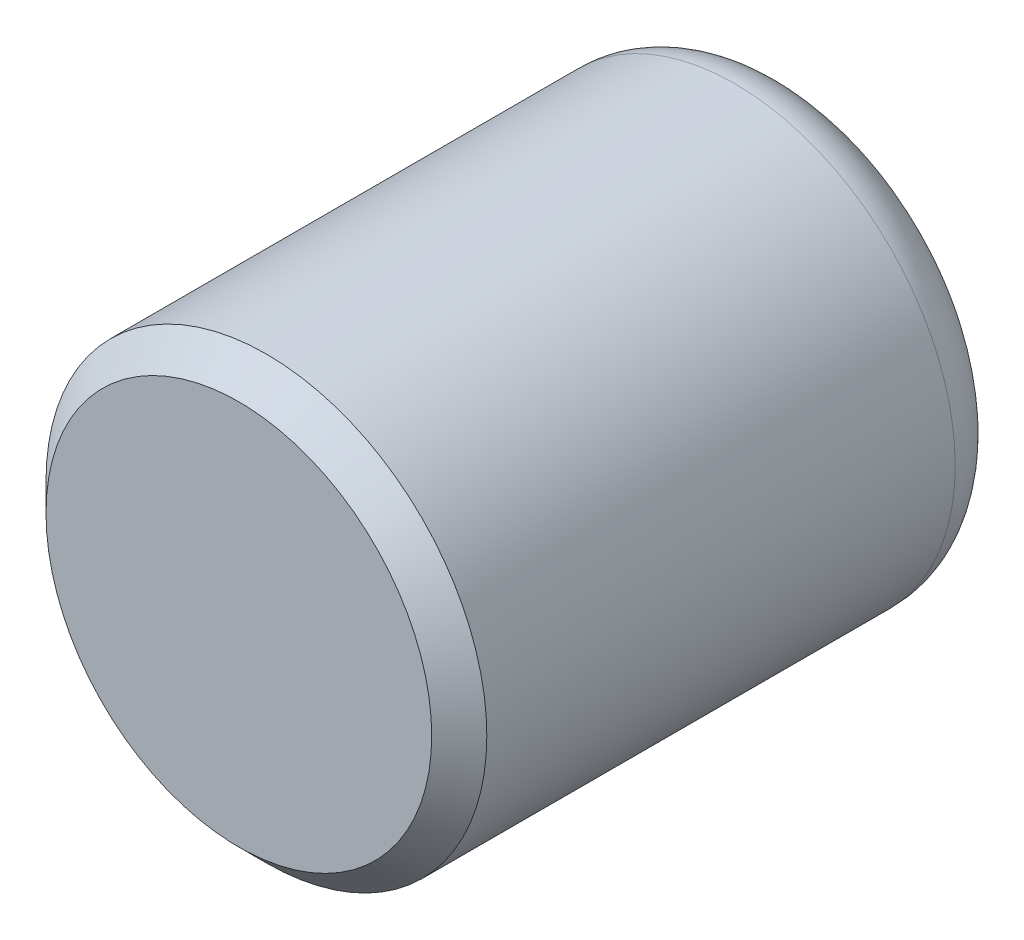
from build123d import *

# Parameters (mm, degrees)
ENLEV_MAT_EXTRU1_DEPTH = 4
CHANFREIN1_SIZE        = 0.5


with BuildPart() as part:
    # Esquisse1 → Base-R_volution (revolve)
    with BuildSketch(Plane(origin=(0, 0, 0), x_dir=(1, 0, 0), z_dir=(0, 1, 0)), mode=Mode.PRIVATE) as base_r_volution_sk:
        with BuildLine():
            Line((0, 0), (4, 0))
            Line((4, 0), (4, 9))
            ThreePointArc((4, 9), (3.707106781, 9.707106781), (3, 10))
            Line((3, 10), (0, 10))
            Line((0, 10), (0, 0))
        make_face()
    revolve(base_r_volution_sk.sketch.rotate(Axis((0, 0, 0), (0, 0, -1)), 180), axis=Axis((0, 0, 0), (0, 0, -1)))

    # Esquisse2 → enlev-mat-Extru1 (cut)
    with BuildSketch(Plane.XY.offset(-10)):
        Polygon((2, -1.154700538), (2, 1.154700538), (0, 2.309401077), (-2, 1.154700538), (-2, -1.154700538), (0, -2.309401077), align=None)
    extrude(amount=ENLEV_MAT_EXTRU1_DEPTH, mode=Mode.SUBTRACT)

    # Chanfrein1
    chanfrein1_edges = [part.edges().sort_by_distance(p)[0] for p in [
        (4, 0, 0),
    ]]
    chamfer(chanfrein1_edges, length=CHANFREIN1_SIZE)


solid = part.part
